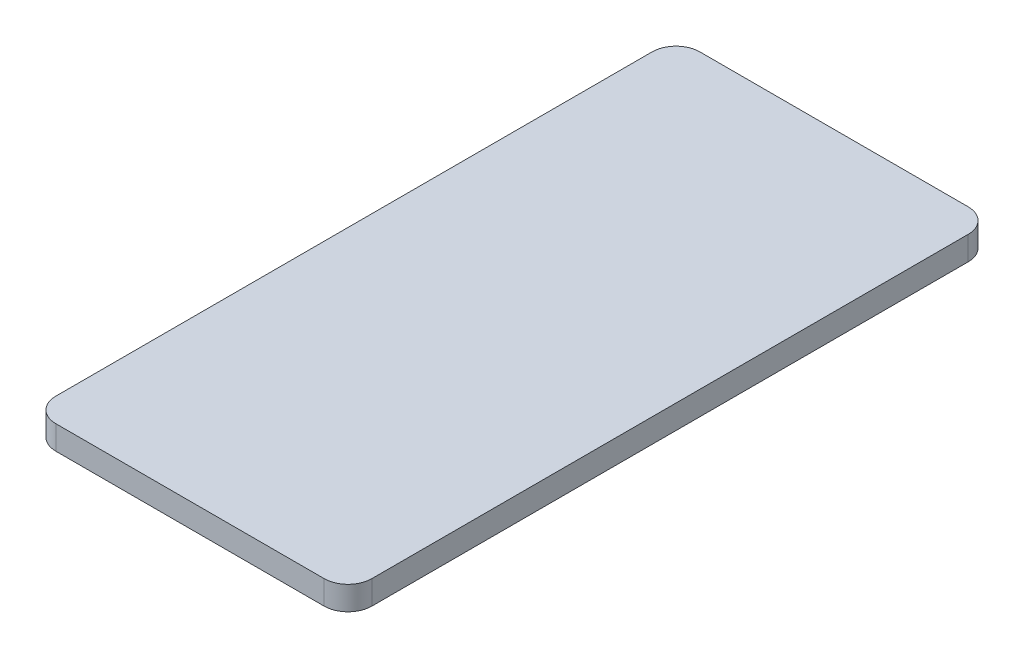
from build123d import *

# Parameters (mm, degrees)
EXTRUDE_1_DEPTH = 2


with BuildPart() as part:
    # Sketch 1 → Extrude 1 (new body)
    with BuildSketch(Plane(origin=(0, 0, 0), x_dir=(1, 0, 0), z_dir=(0, 1, 0))):
        with BuildLine():
            Line((11.25, -27), (-11.25, -27))
            ThreePointArc((-11.25, -27), (-12.664213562, -26.414213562), (-13.25, -25))
            Line((-13.25, -25), (-13.25, 25))
            ThreePointArc((-13.25, 25), (-12.664213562, 26.414213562), (-11.25, 27))
            Line((-11.25, 27), (11.25, 27))
            ThreePointArc((11.25, 27), (12.664213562, 26.414213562), (13.25, 25))
            Line((13.25, 25), (13.25, -25))
            ThreePointArc((13.25, -25), (12.664213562, -26.414213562), (11.25, -27))
        make_face()
    extrude(amount=EXTRUDE_1_DEPTH)


solid = part.part
